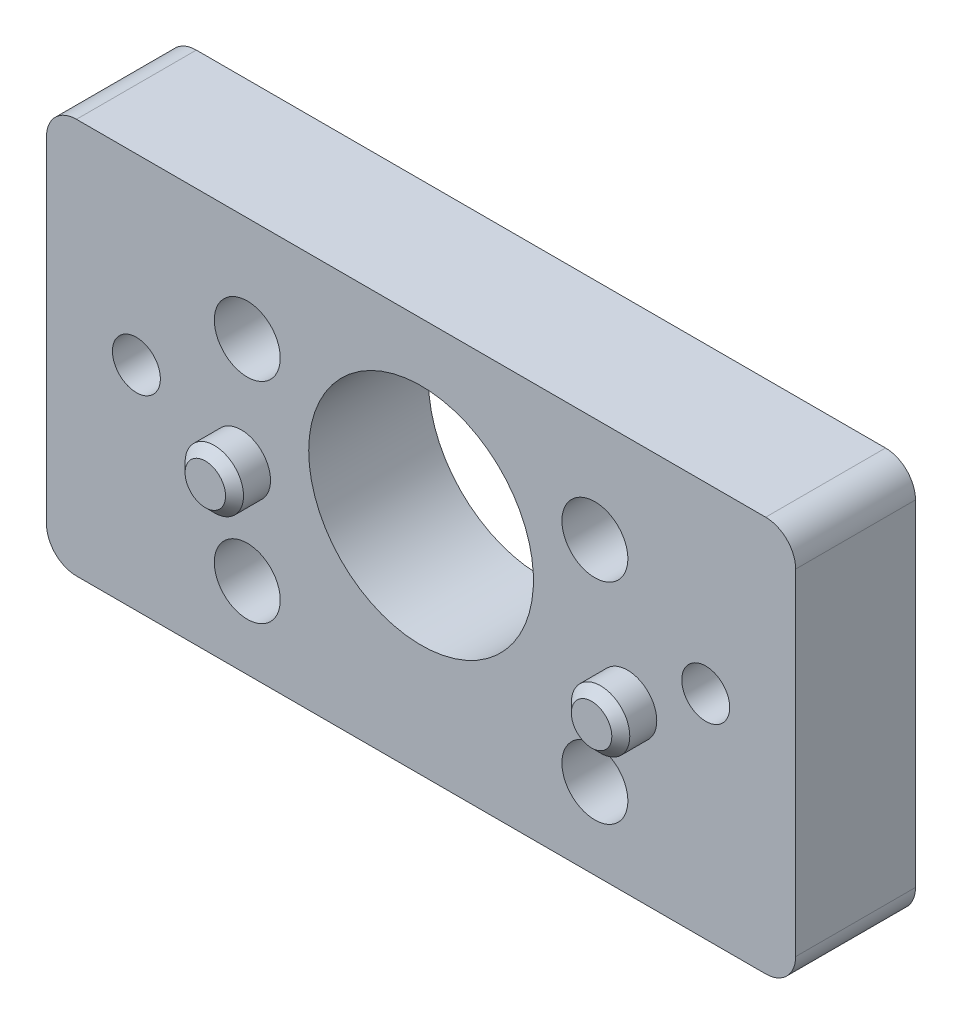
from build123d import *

# Parameters (mm, degrees)
SKETCH_1_W                = 25
SKETCH_1_H                = 12.2
EXTRUDE_1_DEPTH           = 4
HOLE_WIZARD_1_D           = 2.2
HOLE_WIZARD_1_CBORE_D     = 4.2
HOLE_WIZARD_1_CBORE_DEPTH = 2.2
SKETCH_4_R                = 3.75
CUT_EXTRUDE_1_DEPTH       = 15.472732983
SKETCH_5_R                = 0.975
EXTRUDE_2_DEPTH           = 1.2
CHAMFER_1_SIZE            = 0.3
SKETCH_6_R                = 1.025
CUT_EXTRUDE_2_DEPTH       = 2
CHAMFER_2_SIZE            = 0.3
HOLE_WIZARD_M2_1_D        = 1.6
SKETCH_9_W                = 25
SKETCH_9_H                = 4
EXTRUDE_3_DEPTH           = 1
FILLET_1_R                = 1


with BuildPart() as part:
    # Sketch 1 → Extrude 1 (new body)
    with BuildSketch(Plane.XY):
        Rectangle(SKETCH_1_W, SKETCH_1_H)
    extrude(amount=EXTRUDE_1_DEPTH)

    # Hole Wizard 1 (through all)
    with Locations(Plane(origin=(0, 0, 0), x_dir=(-1, 0, 0), z_dir=(0, 0, -1))):
        with Locations((-5.8, 3.6), (5.8, 3.6), (-5.8, -3.4), (5.8, -3.4)):
            CounterBoreHole(HOLE_WIZARD_1_D / 2, HOLE_WIZARD_1_CBORE_D / 2, HOLE_WIZARD_1_CBORE_DEPTH)

    # Sketch 4 → Cut-Extrude 1 (cut, through all)
    with BuildSketch(Plane(origin=(0, 0, 0), x_dir=(-1, 0, 0), z_dir=(0, 0, -1))):
        with Locations((0, 1.4)):
            Circle(SKETCH_4_R)
    extrude(amount=-CUT_EXTRUDE_1_DEPTH, mode=Mode.SUBTRACT)

    # Sketch 5 → Extrude 2 (add)
    with BuildSketch(Plane.XY.offset(4)):
        with Locations((-6, -0.1)):
            Circle(SKETCH_5_R)
        with Locations((6.890306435, -0.6)):
            Circle(SKETCH_5_R)
    extrude(amount=EXTRUDE_2_DEPTH)

    # Chamfer 1
    chamfer_1_edges = [part.edges().sort_by_distance(p)[0] for p in [
        (-6.975, -0.1, 5.2),
        (5.915306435, -0.6, 5.2),
    ]]
    chamfer(chamfer_1_edges, length=CHAMFER_1_SIZE)

    # Sketch 6 → Cut-Extrude 2 (cut)
    with BuildSketch(Plane(origin=(0, 0, 0), x_dir=(-1, 0, 0), z_dir=(0, 0, -1))):
        with Locations((-10, -3.6)):
            Circle(SKETCH_6_R)
        with BuildLine():
            Line((9.5, -2.575), (10.5, -2.575))
            ThreePointArc((10.5, -2.575), (11.525, -3.6), (10.5, -4.625))
            Line((10.5, -4.625), (9.5, -4.625))
            ThreePointArc((9.5, -4.625), (8.475, -3.6), (9.5, -2.575))
        make_face()
    extrude(amount=-CUT_EXTRUDE_2_DEPTH, mode=Mode.SUBTRACT)

    # Chamfer 2
    chamfer_2_edges = [part.edges().sort_by_distance(p)[0] for p in [
        (11.025, -3.6, 0),
        (-8.475, -3.6, 0),
        (-10, -4.625, 0),
        (-11.525, -3.6, 0),
        (-10, -2.575, 0),
    ]]
    chamfer(chamfer_2_edges, length=CHAMFER_2_SIZE)

    # Hole Wizard M2 _1 (through all)
    with Locations(Plane(origin=(0, 0, 0), x_dir=(-1, 0, 0), z_dir=(0, 0, -1))):
        with Locations((-9.5, 1), (9.5, 1)):
            Hole(HOLE_WIZARD_M2_1_D / 2)

    # Sketch 9 → Extrude 3 (add)
    with BuildSketch(Plane(origin=(0, 6.1, 0), x_dir=(1, 0, 0), z_dir=(0, 1, 0))):
        with Locations((0, -2)):
            Rectangle(SKETCH_9_W, SKETCH_9_H)
    extrude(amount=EXTRUDE_3_DEPTH)

    # Fillet 1
    fillet_1_edges = [part.edges().sort_by_distance(p)[0] for p in [
        (12.5, 7.1, 2),
        (-12.5, 7.1, 2),
        (12.5, -6.1, 2),
        (-12.5, -6.1, 2),
    ]]
    fillet(fillet_1_edges, radius=FILLET_1_R)


solid = part.part
